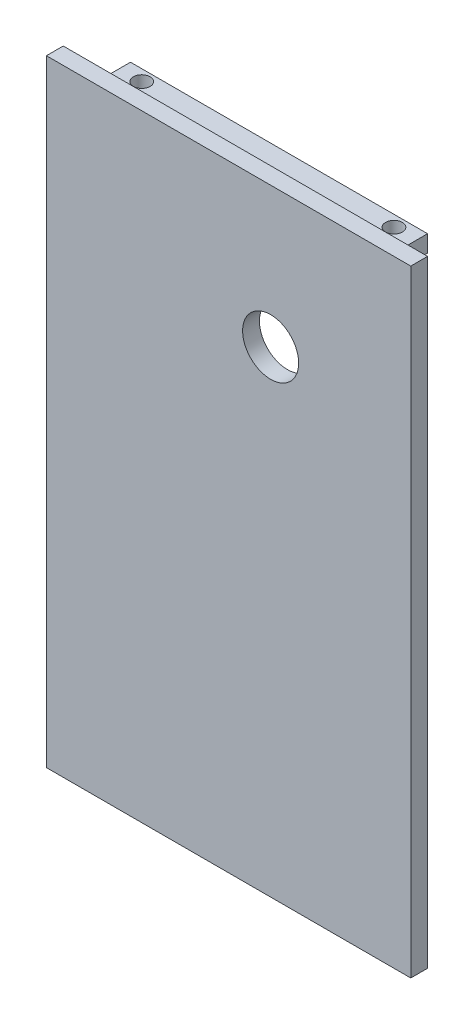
ISO-10303-21;
HEADER;
FILE_DESCRIPTION(('STEP AP214'),'2;1');
FILE_NAME('part.step','',(''),(''),'','','');
FILE_SCHEMA(('AUTOMOTIVE_DESIGN { 1 0 10303 214 1 1 1 1 }'));
ENDSEC;
DATA;
#1=APPLICATION_CONTEXT('core data for automotive mechanical design processes');
#2=APPLICATION_PROTOCOL_DEFINITION('international standard','automotive_design',2000,#1);
#3=PRODUCT_CONTEXT('',#1,'mechanical');
#4=PRODUCT('Part','Part','',(#3));
#5=PRODUCT_RELATED_PRODUCT_CATEGORY('part','',(#4));
#6=PRODUCT_DEFINITION_FORMATION('','',#4);
#7=PRODUCT_DEFINITION_CONTEXT('part definition',#1,'design');
#8=PRODUCT_DEFINITION('design','',#6,#7);
#9=PRODUCT_DEFINITION_SHAPE('','',#8);
#10=(LENGTH_UNIT() NAMED_UNIT(*) SI_UNIT(.MILLI.,.METRE.));
#11=(NAMED_UNIT(*) PLANE_ANGLE_UNIT() SI_UNIT($,.RADIAN.));
#12=(NAMED_UNIT(*) SI_UNIT($,.STERADIAN.) SOLID_ANGLE_UNIT());
#13=UNCERTAINTY_MEASURE_WITH_UNIT(LENGTH_MEASURE(1.E-05),#10,'distance_accuracy_value','');
#14=(GEOMETRIC_REPRESENTATION_CONTEXT(3) GLOBAL_UNCERTAINTY_ASSIGNED_CONTEXT((#13)) GLOBAL_UNIT_ASSIGNED_CONTEXT((#10,
#11,#12)) REPRESENTATION_CONTEXT('',''));
#15=CARTESIAN_POINT('',(0.,0.,0.));
#16=DIRECTION('',(0.,0.,1.));
#17=DIRECTION('',(1.,0.,0.));
#18=AXIS2_PLACEMENT_3D('',#15,#16,#17);
#19=CARTESIAN_POINT('',(32.5,55.,3.));
#20=DIRECTION('',(-1.,0.,0.));
#21=DIRECTION('',(0.,-1.,0.));
#22=AXIS2_PLACEMENT_3D('',#19,#20,#21);
#23=PLANE('',#22);
#24=DIRECTION('',(0.,1.,0.));
#25=VECTOR('',#24,1.);
#26=CARTESIAN_POINT('',(32.5,55.,0.));
#27=LINE('',#26,#25);
#28=CARTESIAN_POINT('',(32.5,-55.,0.));
#29=VERTEX_POINT('',#28);
#30=CARTESIAN_POINT('',(32.5,55.,0.));
#31=VERTEX_POINT('',#30);
#32=EDGE_CURVE('E151',#29,#31,#27,.T.);
#33=ORIENTED_EDGE('',*,*,#32,.T.);
#34=DIRECTION('',(0.,0.,-1.));
#35=VECTOR('',#34,1.);
#36=CARTESIAN_POINT('',(32.5,55.,3.));
#37=LINE('',#36,#35);
#38=CARTESIAN_POINT('',(32.5,55.,3.));
#39=VERTEX_POINT('',#38);
#40=EDGE_CURVE('E197',#39,#31,#37,.T.);
#41=ORIENTED_EDGE('',*,*,#40,.F.);
#42=DIRECTION('',(0.,1.,0.));
#43=VECTOR('',#42,1.);
#44=CARTESIAN_POINT('',(32.5,55.,3.));
#45=LINE('',#44,#43);
#46=CARTESIAN_POINT('',(32.5,-55.,3.));
#47=VERTEX_POINT('',#46);
#48=EDGE_CURVE('E172',#47,#39,#45,.T.);
#49=ORIENTED_EDGE('',*,*,#48,.F.);
#50=DIRECTION('',(0.,0.,-1.));
#51=VECTOR('',#50,1.);
#52=CARTESIAN_POINT('',(32.5,-55.,3.));
#53=LINE('',#52,#51);
#54=EDGE_CURVE('E182',#47,#29,#53,.T.);
#55=ORIENTED_EDGE('',*,*,#54,.T.);
#56=EDGE_LOOP('',(#33,#41,#49,#55));
#57=FACE_BOUND('',#56,.T.);
#58=ADVANCED_FACE('F37',(#57),#23,.F.);
#59=CARTESIAN_POINT('',(-32.5,55.,3.));
#60=DIRECTION('',(0.,-1.,0.));
#61=DIRECTION('',(0.,0.,-1.));
#62=AXIS2_PLACEMENT_3D('',#59,#60,#61);
#63=PLANE('',#62);
#64=DIRECTION('',(-1.,0.,0.));
#65=VECTOR('',#64,1.);
#66=CARTESIAN_POINT('',(-32.5,55.,0.));
#67=LINE('',#66,#65);
#68=CARTESIAN_POINT('',(-32.5,55.,0.));
#69=VERTEX_POINT('',#68);
#70=EDGE_CURVE('E184',#31,#69,#67,.T.);
#71=ORIENTED_EDGE('',*,*,#70,.T.);
#72=DIRECTION('',(0.,0.,-1.));
#73=VECTOR('',#72,1.);
#74=CARTESIAN_POINT('',(-32.5,55.,3.));
#75=LINE('',#74,#73);
#76=CARTESIAN_POINT('',(-32.5,55.,3.));
#77=VERTEX_POINT('',#76);
#78=EDGE_CURVE('E194',#77,#69,#75,.T.);
#79=ORIENTED_EDGE('',*,*,#78,.F.);
#80=DIRECTION('',(-1.,0.,0.));
#81=VECTOR('',#80,1.);
#82=CARTESIAN_POINT('',(-32.5,55.,3.));
#83=LINE('',#82,#81);
#84=EDGE_CURVE('E175',#39,#77,#83,.T.);
#85=ORIENTED_EDGE('',*,*,#84,.F.);
#86=ORIENTED_EDGE('',*,*,#40,.T.);
#87=EDGE_LOOP('',(#71,#79,#85,#86));
#88=FACE_BOUND('',#87,.T.);
#89=ADVANCED_FACE('F279',(#88),#63,.F.);
#90=CARTESIAN_POINT('',(-32.5,55.,3.));
#91=DIRECTION('',(1.,0.,0.));
#92=DIRECTION('',(0.,1.,0.));
#93=AXIS2_PLACEMENT_3D('',#90,#91,#92);
#94=PLANE('',#93);
#95=DIRECTION('',(0.,-1.,0.));
#96=VECTOR('',#95,1.);
#97=CARTESIAN_POINT('',(-32.5,55.,0.));
#98=LINE('',#97,#96);
#99=CARTESIAN_POINT('',(-32.5,-55.,0.));
#100=VERTEX_POINT('',#99);
#101=EDGE_CURVE('E186',#69,#100,#98,.T.);
#102=ORIENTED_EDGE('',*,*,#101,.T.);
#103=DIRECTION('',(0.,0.,-1.));
#104=VECTOR('',#103,1.);
#105=CARTESIAN_POINT('',(-32.5,-55.,3.));
#106=LINE('',#105,#104);
#107=CARTESIAN_POINT('',(-32.5,-55.,3.));
#108=VERTEX_POINT('',#107);
#109=EDGE_CURVE('E191',#108,#100,#106,.T.);
#110=ORIENTED_EDGE('',*,*,#109,.F.);
#111=DIRECTION('',(0.,-1.,0.));
#112=VECTOR('',#111,1.);
#113=CARTESIAN_POINT('',(-32.5,55.,3.));
#114=LINE('',#113,#112);
#115=EDGE_CURVE('E178',#77,#108,#114,.T.);
#116=ORIENTED_EDGE('',*,*,#115,.F.);
#117=ORIENTED_EDGE('',*,*,#78,.T.);
#118=EDGE_LOOP('',(#102,#110,#116,#117));
#119=FACE_BOUND('',#118,.T.);
#120=ADVANCED_FACE('F284',(#119),#94,.F.);
#121=CARTESIAN_POINT('',(-32.5,-55.,3.));
#122=DIRECTION('',(0.,1.,0.));
#123=DIRECTION('',(0.,0.,1.));
#124=AXIS2_PLACEMENT_3D('',#121,#122,#123);
#125=PLANE('',#124);
#126=DIRECTION('',(1.,0.,0.));
#127=VECTOR('',#126,1.);
#128=CARTESIAN_POINT('',(-32.5,-55.,0.));
#129=LINE('',#128,#127);
#130=EDGE_CURVE('E176',#100,#29,#129,.T.);
#131=ORIENTED_EDGE('',*,*,#130,.T.);
#132=ORIENTED_EDGE('',*,*,#54,.F.);
#133=DIRECTION('',(1.,0.,0.));
#134=VECTOR('',#133,1.);
#135=CARTESIAN_POINT('',(-32.5,-55.,3.));
#136=LINE('',#135,#134);
#137=EDGE_CURVE('E180',#108,#47,#136,.T.);
#138=ORIENTED_EDGE('',*,*,#137,.F.);
#139=ORIENTED_EDGE('',*,*,#109,.T.);
#140=EDGE_LOOP('',(#131,#132,#138,#139));
#141=FACE_BOUND('',#140,.T.);
#142=ADVANCED_FACE('F301',(#141),#125,.F.);
#143=CARTESIAN_POINT('',(0.,0.,3.));
#144=DIRECTION('',(0.,0.,1.));
#145=DIRECTION('',(1.,0.,0.));
#146=AXIS2_PLACEMENT_3D('',#143,#144,#145);
#147=PLANE('',#146);
#148=CARTESIAN_POINT('',(7.49999999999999,30.,3.));
#149=DIRECTION('',(0.,0.,1.));
#150=DIRECTION('',(1.,0.,0.));
#151=AXIS2_PLACEMENT_3D('',#148,#149,#150);
#152=CIRCLE('',#151,5.00000000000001);
#153=CARTESIAN_POINT('',(12.5,30.,3.));
#154=VERTEX_POINT('',#153);
#155=EDGE_CURVE('E203',#154,#154,#152,.T.);
#156=ORIENTED_EDGE('',*,*,#155,.F.);
#157=EDGE_LOOP('',(#156));
#158=FACE_BOUND('',#157,.T.);
#159=ORIENTED_EDGE('',*,*,#48,.T.);
#160=ORIENTED_EDGE('',*,*,#84,.T.);
#161=ORIENTED_EDGE('',*,*,#115,.T.);
#162=ORIENTED_EDGE('',*,*,#137,.T.);
#163=EDGE_LOOP('',(#159,#160,#161,#162));
#164=FACE_BOUND('',#163,.T.);
#165=ADVANCED_FACE('F297',(#158,#164),#147,.T.);
#166=CARTESIAN_POINT('',(0.,0.,0.));
#167=DIRECTION('',(0.,0.,1.));
#168=DIRECTION('',(1.,0.,0.));
#169=AXIS2_PLACEMENT_3D('',#166,#167,#168);
#170=PLANE('',#169);
#171=CARTESIAN_POINT('',(7.49999999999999,30.,0.));
#172=DIRECTION('',(0.,0.,1.));
#173=DIRECTION('',(1.,0.,0.));
#174=AXIS2_PLACEMENT_3D('',#171,#172,#173);
#175=CIRCLE('',#174,5.00000000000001);
#176=CARTESIAN_POINT('',(12.5,30.,0.));
#177=VERTEX_POINT('',#176);
#178=EDGE_CURVE('E201',#177,#177,#175,.T.);
#179=ORIENTED_EDGE('',*,*,#178,.T.);
#180=EDGE_LOOP('',(#179));
#181=FACE_BOUND('',#180,.T.);
#182=DIRECTION('',(0.,-1.,0.));
#183=VECTOR('',#182,1.);
#184=CARTESIAN_POINT('',(-26.5,55.,0.));
#185=LINE('',#184,#183);
#186=CARTESIAN_POINT('',(-26.5,52.5,0.));
#187=VERTEX_POINT('',#186);
#188=CARTESIAN_POINT('',(-26.5,49.5,0.));
#189=VERTEX_POINT('',#188);
#190=EDGE_CURVE('E232',#187,#189,#185,.T.);
#191=ORIENTED_EDGE('',*,*,#190,.T.);
#192=DIRECTION('',(-1.,0.,0.));
#193=VECTOR('',#192,1.);
#194=CARTESIAN_POINT('',(32.5,49.5,0.));
#195=LINE('',#194,#193);
#196=CARTESIAN_POINT('',(26.5,49.5,0.));
#197=VERTEX_POINT('',#196);
#198=EDGE_CURVE('E159',#197,#189,#195,.T.);
#199=ORIENTED_EDGE('',*,*,#198,.F.);
#200=DIRECTION('',(0.,-1.,0.));
#201=VECTOR('',#200,1.);
#202=CARTESIAN_POINT('',(26.5,55.,0.));
#203=LINE('',#202,#201);
#204=CARTESIAN_POINT('',(26.5,52.5,0.));
#205=VERTEX_POINT('',#204);
#206=EDGE_CURVE('E53',#205,#197,#203,.T.);
#207=ORIENTED_EDGE('',*,*,#206,.F.);
#208=DIRECTION('',(-1.,0.,0.));
#209=VECTOR('',#208,1.);
#210=CARTESIAN_POINT('',(32.5,52.5,0.));
#211=LINE('',#210,#209);
#212=EDGE_CURVE('E168',#205,#187,#211,.T.);
#213=ORIENTED_EDGE('',*,*,#212,.T.);
#214=EDGE_LOOP('',(#191,#199,#207,#213));
#215=FACE_BOUND('',#214,.T.);
#216=ORIENTED_EDGE('',*,*,#101,.F.);
#217=ORIENTED_EDGE('',*,*,#70,.F.);
#218=ORIENTED_EDGE('',*,*,#32,.F.);
#219=ORIENTED_EDGE('',*,*,#130,.F.);
#220=EDGE_LOOP('',(#216,#217,#218,#219));
#221=FACE_BOUND('',#220,.T.);
#222=DIRECTION('',(-1.,0.,0.));
#223=VECTOR('',#222,1.);
#224=CARTESIAN_POINT('',(32.5,-49.5,0.));
#225=LINE('',#224,#223);
#226=CARTESIAN_POINT('',(26.5,-49.5,0.));
#227=VERTEX_POINT('',#226);
#228=CARTESIAN_POINT('',(-26.5,-49.5,0.));
#229=VERTEX_POINT('',#228);
#230=EDGE_CURVE('E153',#227,#229,#225,.T.);
#231=ORIENTED_EDGE('',*,*,#230,.T.);
#232=CARTESIAN_POINT('',(-26.5,-52.5,0.));
#233=VERTEX_POINT('',#232);
#234=EDGE_CURVE('E231',#229,#233,#185,.T.);
#235=ORIENTED_EDGE('',*,*,#234,.T.);
#236=DIRECTION('',(-1.,0.,0.));
#237=VECTOR('',#236,1.);
#238=CARTESIAN_POINT('',(32.5,-52.5,0.));
#239=LINE('',#238,#237);
#240=CARTESIAN_POINT('',(26.5,-52.5,0.));
#241=VERTEX_POINT('',#240);
#242=EDGE_CURVE('E143',#241,#233,#239,.T.);
#243=ORIENTED_EDGE('',*,*,#242,.F.);
#244=EDGE_CURVE('E234',#227,#241,#203,.T.);
#245=ORIENTED_EDGE('',*,*,#244,.F.);
#246=EDGE_LOOP('',(#231,#235,#243,#245));
#247=FACE_BOUND('',#246,.T.);
#248=ADVANCED_FACE('F259',(#181,#215,#221,#247),#170,.F.);
#249=CARTESIAN_POINT('',(32.5,52.5,-6.));
#250=DIRECTION('',(0.,0.,-1.));
#251=DIRECTION('',(0.,1.,0.));
#252=AXIS2_PLACEMENT_3D('',#249,#250,#251);
#253=PLANE('',#252);
#254=DIRECTION('',(0.,-1.,0.));
#255=VECTOR('',#254,1.);
#256=CARTESIAN_POINT('',(-26.5,55.,-6.));
#257=LINE('',#256,#255);
#258=CARTESIAN_POINT('',(-26.5,52.5,-6.));
#259=VERTEX_POINT('',#258);
#260=CARTESIAN_POINT('',(-26.5,49.5,-6.));
#261=VERTEX_POINT('',#260);
#262=EDGE_CURVE('E61',#259,#261,#257,.T.);
#263=ORIENTED_EDGE('',*,*,#262,.F.);
#264=DIRECTION('',(-1.,0.,0.));
#265=VECTOR('',#264,1.);
#266=CARTESIAN_POINT('',(32.5,52.5,-6.));
#267=LINE('',#266,#265);
#268=CARTESIAN_POINT('',(26.5,52.5,-6.));
#269=VERTEX_POINT('',#268);
#270=EDGE_CURVE('E165',#269,#259,#267,.T.);
#271=ORIENTED_EDGE('',*,*,#270,.F.);
#272=DIRECTION('',(0.,-1.,0.));
#273=VECTOR('',#272,1.);
#274=CARTESIAN_POINT('',(26.5,55.,-6.));
#275=LINE('',#274,#273);
#276=CARTESIAN_POINT('',(26.5,49.5,-6.));
#277=VERTEX_POINT('',#276);
#278=EDGE_CURVE('E236',#269,#277,#275,.T.);
#279=ORIENTED_EDGE('',*,*,#278,.T.);
#280=DIRECTION('',(-1.,0.,0.));
#281=VECTOR('',#280,1.);
#282=CARTESIAN_POINT('',(32.5,49.5,-6.));
#283=LINE('',#282,#281);
#284=EDGE_CURVE('E162',#277,#261,#283,.T.);
#285=ORIENTED_EDGE('',*,*,#284,.T.);
#286=EDGE_LOOP('',(#263,#271,#279,#285));
#287=FACE_BOUND('',#286,.T.);
#288=ADVANCED_FACE('F251',(#287),#253,.T.);
#289=CARTESIAN_POINT('',(32.5,52.5,0.));
#290=DIRECTION('',(0.,1.,0.));
#291=DIRECTION('',(-1.,0.,0.));
#292=AXIS2_PLACEMENT_3D('',#289,#290,#291);
#293=PLANE('',#292);
#294=CARTESIAN_POINT('',(-22.5,52.5,-4.));
#295=DIRECTION('',(0.,1.,0.));
#296=DIRECTION('',(-1.,0.,0.));
#297=AXIS2_PLACEMENT_3D('',#294,#295,#296);
#298=CIRCLE('',#297,1.5);
#299=CARTESIAN_POINT('',(-24.,52.5,-4.));
#300=VERTEX_POINT('',#299);
#301=EDGE_CURVE('E207',#300,#300,#298,.T.);
#302=ORIENTED_EDGE('',*,*,#301,.F.);
#303=EDGE_LOOP('',(#302));
#304=FACE_BOUND('',#303,.T.);
#305=CARTESIAN_POINT('',(22.5,52.5,-4.));
#306=DIRECTION('',(0.,1.,0.));
#307=DIRECTION('',(-1.,0.,0.));
#308=AXIS2_PLACEMENT_3D('',#305,#306,#307);
#309=CIRCLE('',#308,1.5);
#310=CARTESIAN_POINT('',(21.,52.5,-4.));
#311=VERTEX_POINT('',#310);
#312=EDGE_CURVE('E214',#311,#311,#309,.T.);
#313=ORIENTED_EDGE('',*,*,#312,.F.);
#314=EDGE_LOOP('',(#313));
#315=FACE_BOUND('',#314,.T.);
#316=DIRECTION('',(0.,0.,-1.));
#317=VECTOR('',#316,1.);
#318=CARTESIAN_POINT('',(-26.5,52.5,0.));
#319=LINE('',#318,#317);
#320=EDGE_CURVE('E171',#187,#259,#319,.T.);
#321=ORIENTED_EDGE('',*,*,#320,.F.);
#322=ORIENTED_EDGE('',*,*,#212,.F.);
#323=DIRECTION('',(0.,0.,1.));
#324=VECTOR('',#323,1.);
#325=CARTESIAN_POINT('',(26.5,52.5,0.));
#326=LINE('',#325,#324);
#327=EDGE_CURVE('E241',#269,#205,#326,.T.);
#328=ORIENTED_EDGE('',*,*,#327,.F.);
#329=ORIENTED_EDGE('',*,*,#270,.T.);
#330=EDGE_LOOP('',(#321,#322,#328,#329));
#331=FACE_BOUND('',#330,.T.);
#332=ADVANCED_FACE('F255',(#304,#315,#331),#293,.T.);
#333=CARTESIAN_POINT('',(32.5,49.5,-6.));
#334=DIRECTION('',(0.,-1.,0.));
#335=DIRECTION('',(1.,0.,0.));
#336=AXIS2_PLACEMENT_3D('',#333,#334,#335);
#337=PLANE('',#336);
#338=CARTESIAN_POINT('',(-22.5,49.5,-4.));
#339=DIRECTION('',(0.,-1.,0.));
#340=DIRECTION('',(1.,0.,0.));
#341=AXIS2_PLACEMENT_3D('',#338,#339,#340);
#342=CIRCLE('',#341,1.5);
#343=CARTESIAN_POINT('',(-21.,49.5,-4.));
#344=VERTEX_POINT('',#343);
#345=EDGE_CURVE('E226',#344,#344,#342,.T.);
#346=ORIENTED_EDGE('',*,*,#345,.F.);
#347=EDGE_LOOP('',(#346));
#348=FACE_BOUND('',#347,.T.);
#349=CARTESIAN_POINT('',(22.5,49.5,-4.));
#350=DIRECTION('',(0.,-1.,0.));
#351=DIRECTION('',(1.,0.,0.));
#352=AXIS2_PLACEMENT_3D('',#349,#350,#351);
#353=CIRCLE('',#352,1.5);
#354=CARTESIAN_POINT('',(24.,49.5,-4.));
#355=VERTEX_POINT('',#354);
#356=EDGE_CURVE('E211',#355,#355,#353,.T.);
#357=ORIENTED_EDGE('',*,*,#356,.F.);
#358=EDGE_LOOP('',(#357));
#359=FACE_BOUND('',#358,.T.);
#360=DIRECTION('',(0.,0.,1.));
#361=VECTOR('',#360,1.);
#362=CARTESIAN_POINT('',(-26.5,49.5,-6.));
#363=LINE('',#362,#361);
#364=EDGE_CURVE('E243',#261,#189,#363,.T.);
#365=ORIENTED_EDGE('',*,*,#364,.F.);
#366=ORIENTED_EDGE('',*,*,#284,.F.);
#367=DIRECTION('',(0.,0.,-1.));
#368=VECTOR('',#367,1.);
#369=CARTESIAN_POINT('',(26.5,49.5,-6.));
#370=LINE('',#369,#368);
#371=EDGE_CURVE('E239',#197,#277,#370,.T.);
#372=ORIENTED_EDGE('',*,*,#371,.F.);
#373=ORIENTED_EDGE('',*,*,#198,.T.);
#374=EDGE_LOOP('',(#365,#366,#372,#373));
#375=FACE_BOUND('',#374,.T.);
#376=ADVANCED_FACE('F262',(#348,#359,#375),#337,.T.);
#377=CARTESIAN_POINT('',(32.5,-52.5,0.));
#378=DIRECTION('',(0.,-1.,0.));
#379=DIRECTION('',(1.,0.,0.));
#380=AXIS2_PLACEMENT_3D('',#377,#378,#379);
#381=PLANE('',#380);
#382=CARTESIAN_POINT('',(-22.5,-52.5,-4.));
#383=DIRECTION('',(0.,-1.,0.));
#384=DIRECTION('',(1.,0.,0.));
#385=AXIS2_PLACEMENT_3D('',#382,#383,#384);
#386=CIRCLE('',#385,1.5);
#387=CARTESIAN_POINT('',(-21.,-52.5,-4.));
#388=VERTEX_POINT('',#387);
#389=EDGE_CURVE('E223',#388,#388,#386,.T.);
#390=ORIENTED_EDGE('',*,*,#389,.F.);
#391=EDGE_LOOP('',(#390));
#392=FACE_BOUND('',#391,.T.);
#393=CARTESIAN_POINT('',(22.5,-52.5,-4.));
#394=DIRECTION('',(0.,-1.,0.));
#395=DIRECTION('',(1.,0.,0.));
#396=AXIS2_PLACEMENT_3D('',#393,#394,#395);
#397=CIRCLE('',#396,1.5);
#398=CARTESIAN_POINT('',(24.,-52.5,-4.));
#399=VERTEX_POINT('',#398);
#400=EDGE_CURVE('E206',#399,#399,#397,.T.);
#401=ORIENTED_EDGE('',*,*,#400,.F.);
#402=EDGE_LOOP('',(#401));
#403=FACE_BOUND('',#402,.T.);
#404=DIRECTION('',(0.,0.,1.));
#405=VECTOR('',#404,1.);
#406=CARTESIAN_POINT('',(-26.5,-52.5,0.));
#407=LINE('',#406,#405);
#408=CARTESIAN_POINT('',(-26.5,-52.5,-6.));
#409=VERTEX_POINT('',#408);
#410=EDGE_CURVE('E129',#409,#233,#407,.T.);
#411=ORIENTED_EDGE('',*,*,#410,.F.);
#412=DIRECTION('',(-1.,0.,0.));
#413=VECTOR('',#412,1.);
#414=CARTESIAN_POINT('',(32.5,-52.5,-6.));
#415=LINE('',#414,#413);
#416=CARTESIAN_POINT('',(26.5,-52.5,-6.));
#417=VERTEX_POINT('',#416);
#418=EDGE_CURVE('E141',#417,#409,#415,.T.);
#419=ORIENTED_EDGE('',*,*,#418,.F.);
#420=DIRECTION('',(0.,0.,-1.));
#421=VECTOR('',#420,1.);
#422=CARTESIAN_POINT('',(26.5,-52.5,-6.));
#423=LINE('',#422,#421);
#424=EDGE_CURVE('E144',#241,#417,#423,.T.);
#425=ORIENTED_EDGE('',*,*,#424,.F.);
#426=ORIENTED_EDGE('',*,*,#242,.T.);
#427=EDGE_LOOP('',(#411,#419,#425,#426));
#428=FACE_BOUND('',#427,.T.);
#429=ADVANCED_FACE('F139',(#392,#403,#428),#381,.T.);
#430=CARTESIAN_POINT('',(32.5,-52.5,-6.));
#431=DIRECTION('',(0.,0.,-1.));
#432=DIRECTION('',(0.,1.,0.));
#433=AXIS2_PLACEMENT_3D('',#430,#431,#432);
#434=PLANE('',#433);
#435=CARTESIAN_POINT('',(-26.5,-49.5,-6.));
#436=VERTEX_POINT('',#435);
#437=EDGE_CURVE('E126',#436,#409,#257,.T.);
#438=ORIENTED_EDGE('',*,*,#437,.F.);
#439=DIRECTION('',(-1.,0.,0.));
#440=VECTOR('',#439,1.);
#441=CARTESIAN_POINT('',(32.5,-49.5,-6.));
#442=LINE('',#441,#440);
#443=CARTESIAN_POINT('',(26.5,-49.5,-6.));
#444=VERTEX_POINT('',#443);
#445=EDGE_CURVE('E149',#444,#436,#442,.T.);
#446=ORIENTED_EDGE('',*,*,#445,.F.);
#447=EDGE_CURVE('E148',#444,#417,#275,.T.);
#448=ORIENTED_EDGE('',*,*,#447,.T.);
#449=ORIENTED_EDGE('',*,*,#418,.T.);
#450=EDGE_LOOP('',(#438,#446,#448,#449));
#451=FACE_BOUND('',#450,.T.);
#452=ADVANCED_FACE('F147',(#451),#434,.T.);
#453=CARTESIAN_POINT('',(32.5,-49.5,-6.));
#454=DIRECTION('',(0.,1.,0.));
#455=DIRECTION('',(-1.,0.,0.));
#456=AXIS2_PLACEMENT_3D('',#453,#454,#455);
#457=PLANE('',#456);
#458=CARTESIAN_POINT('',(-22.5,-49.5,-4.));
#459=DIRECTION('',(0.,1.,0.));
#460=DIRECTION('',(-1.,0.,0.));
#461=AXIS2_PLACEMENT_3D('',#458,#459,#460);
#462=CIRCLE('',#461,1.5);
#463=CARTESIAN_POINT('',(-24.,-49.5,-4.));
#464=VERTEX_POINT('',#463);
#465=EDGE_CURVE('E40',#464,#464,#462,.T.);
#466=ORIENTED_EDGE('',*,*,#465,.F.);
#467=EDGE_LOOP('',(#466));
#468=FACE_BOUND('',#467,.T.);
#469=CARTESIAN_POINT('',(22.5,-49.5,-4.));
#470=DIRECTION('',(0.,1.,0.));
#471=DIRECTION('',(-1.,0.,0.));
#472=AXIS2_PLACEMENT_3D('',#469,#470,#471);
#473=CIRCLE('',#472,1.5);
#474=CARTESIAN_POINT('',(21.,-49.5,-4.));
#475=VERTEX_POINT('',#474);
#476=EDGE_CURVE('E204',#475,#475,#473,.T.);
#477=ORIENTED_EDGE('',*,*,#476,.F.);
#478=EDGE_LOOP('',(#477));
#479=FACE_BOUND('',#478,.T.);
#480=DIRECTION('',(0.,0.,-1.));
#481=VECTOR('',#480,1.);
#482=CARTESIAN_POINT('',(-26.5,-49.5,-6.));
#483=LINE('',#482,#481);
#484=EDGE_CURVE('E11',#229,#436,#483,.T.);
#485=ORIENTED_EDGE('',*,*,#484,.F.);
#486=ORIENTED_EDGE('',*,*,#230,.F.);
#487=DIRECTION('',(0.,0.,1.));
#488=VECTOR('',#487,1.);
#489=CARTESIAN_POINT('',(26.5,-49.5,-6.));
#490=LINE('',#489,#488);
#491=EDGE_CURVE('E45',#444,#227,#490,.T.);
#492=ORIENTED_EDGE('',*,*,#491,.F.);
#493=ORIENTED_EDGE('',*,*,#445,.T.);
#494=EDGE_LOOP('',(#485,#486,#492,#493));
#495=FACE_BOUND('',#494,.T.);
#496=ADVANCED_FACE('F350',(#468,#479,#495),#457,.T.);
#497=CARTESIAN_POINT('',(26.5,55.,-6.));
#498=DIRECTION('',(-1.,0.,0.));
#499=DIRECTION('',(0.,-1.,0.));
#500=AXIS2_PLACEMENT_3D('',#497,#498,#499);
#501=PLANE('',#500);
#502=ORIENTED_EDGE('',*,*,#491,.T.);
#503=ORIENTED_EDGE('',*,*,#244,.T.);
#504=ORIENTED_EDGE('',*,*,#424,.T.);
#505=ORIENTED_EDGE('',*,*,#447,.F.);
#506=EDGE_LOOP('',(#502,#503,#504,#505));
#507=FACE_BOUND('',#506,.T.);
#508=ADVANCED_FACE('F355',(#507),#501,.F.);
#509=CARTESIAN_POINT('',(-26.5,55.,0.));
#510=DIRECTION('',(1.,0.,0.));
#511=DIRECTION('',(0.,1.,0.));
#512=AXIS2_PLACEMENT_3D('',#509,#510,#511);
#513=PLANE('',#512);
#514=ORIENTED_EDGE('',*,*,#484,.T.);
#515=ORIENTED_EDGE('',*,*,#437,.T.);
#516=ORIENTED_EDGE('',*,*,#410,.T.);
#517=ORIENTED_EDGE('',*,*,#234,.F.);
#518=EDGE_LOOP('',(#514,#515,#516,#517));
#519=FACE_BOUND('',#518,.T.);
#520=ADVANCED_FACE('F128',(#519),#513,.F.);
#521=ORIENTED_EDGE('',*,*,#327,.T.);
#522=ORIENTED_EDGE('',*,*,#206,.T.);
#523=ORIENTED_EDGE('',*,*,#371,.T.);
#524=ORIENTED_EDGE('',*,*,#278,.F.);
#525=EDGE_LOOP('',(#521,#522,#523,#524));
#526=FACE_BOUND('',#525,.T.);
#527=ADVANCED_FACE('F256',(#526),#501,.F.);
#528=ORIENTED_EDGE('',*,*,#320,.T.);
#529=ORIENTED_EDGE('',*,*,#262,.T.);
#530=ORIENTED_EDGE('',*,*,#364,.T.);
#531=ORIENTED_EDGE('',*,*,#190,.F.);
#532=EDGE_LOOP('',(#528,#529,#530,#531));
#533=FACE_BOUND('',#532,.T.);
#534=ADVANCED_FACE('F245',(#533),#513,.F.);
#535=CARTESIAN_POINT('',(7.49999999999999,30.,-6.));
#536=DIRECTION('',(0.,0.,1.));
#537=DIRECTION('',(1.,0.,0.));
#538=AXIS2_PLACEMENT_3D('',#535,#536,#537);
#539=CYLINDRICAL_SURFACE('',#538,5.00000000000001);
#540=ORIENTED_EDGE('',*,*,#155,.T.);
#541=EDGE_LOOP('',(#540));
#542=FACE_BOUND('',#541,.T.);
#543=ORIENTED_EDGE('',*,*,#178,.F.);
#544=EDGE_LOOP('',(#543));
#545=FACE_BOUND('',#544,.T.);
#546=ADVANCED_FACE('F332',(#542,#545),#539,.F.);
#547=CARTESIAN_POINT('',(22.5,-55.,-4.));
#548=DIRECTION('',(0.,1.,0.));
#549=DIRECTION('',(-1.,0.,0.));
#550=AXIS2_PLACEMENT_3D('',#547,#548,#549);
#551=CYLINDRICAL_SURFACE('',#550,1.5);
#552=ORIENTED_EDGE('',*,*,#400,.T.);
#553=EDGE_LOOP('',(#552));
#554=FACE_BOUND('',#553,.T.);
#555=ORIENTED_EDGE('',*,*,#476,.T.);
#556=EDGE_LOOP('',(#555));
#557=FACE_BOUND('',#556,.T.);
#558=ADVANCED_FACE('F363',(#554,#557),#551,.F.);
#559=CARTESIAN_POINT('',(-22.5,-55.,-4.));
#560=DIRECTION('',(0.,1.,0.));
#561=DIRECTION('',(-1.,0.,0.));
#562=AXIS2_PLACEMENT_3D('',#559,#560,#561);
#563=CYLINDRICAL_SURFACE('',#562,1.5);
#564=ORIENTED_EDGE('',*,*,#389,.T.);
#565=EDGE_LOOP('',(#564));
#566=FACE_BOUND('',#565,.T.);
#567=ORIENTED_EDGE('',*,*,#465,.T.);
#568=EDGE_LOOP('',(#567));
#569=FACE_BOUND('',#568,.T.);
#570=ADVANCED_FACE('F368',(#566,#569),#563,.F.);
#571=ORIENTED_EDGE('',*,*,#356,.T.);
#572=EDGE_LOOP('',(#571));
#573=FACE_BOUND('',#572,.T.);
#574=ORIENTED_EDGE('',*,*,#312,.T.);
#575=EDGE_LOOP('',(#574));
#576=FACE_BOUND('',#575,.T.);
#577=ADVANCED_FACE('F371',(#573,#576),#551,.F.);
#578=ORIENTED_EDGE('',*,*,#345,.T.);
#579=EDGE_LOOP('',(#578));
#580=FACE_BOUND('',#579,.T.);
#581=ORIENTED_EDGE('',*,*,#301,.T.);
#582=EDGE_LOOP('',(#581));
#583=FACE_BOUND('',#582,.T.);
#584=ADVANCED_FACE('F382',(#580,#583),#563,.F.);
#585=CLOSED_SHELL('',(#58,#89,#120,#142,#165,#248,#288,#332,#376,#429,#452,#496,#508,#520,#527,
#534,#546,#558,#570,#577,#584));
#586=MANIFOLD_SOLID_BREP('B2',#585);
#587=ADVANCED_BREP_SHAPE_REPRESENTATION('',(#18,#586),#14);
#588=SHAPE_DEFINITION_REPRESENTATION(#9,#587);
ENDSEC;
END-ISO-10303-21;
